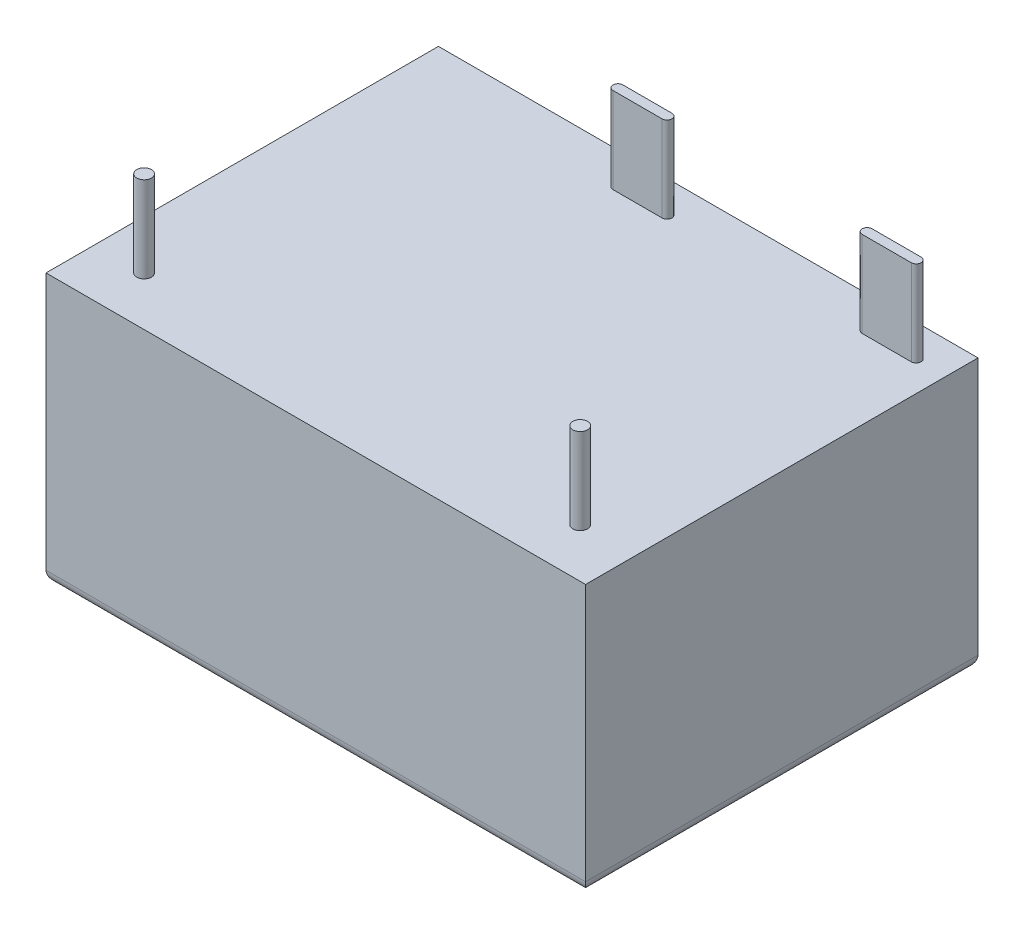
ISO-10303-21;
HEADER;
FILE_DESCRIPTION(('STEP AP214'),'2;1');
FILE_NAME('part.step','',(''),(''),'','','');
FILE_SCHEMA(('AUTOMOTIVE_DESIGN { 1 0 10303 214 1 1 1 1 }'));
ENDSEC;
DATA;
#1=APPLICATION_CONTEXT('core data for automotive mechanical design processes');
#2=APPLICATION_PROTOCOL_DEFINITION('international standard','automotive_design',2000,#1);
#3=PRODUCT_CONTEXT('',#1,'mechanical');
#4=PRODUCT('Part','Part','',(#3));
#5=PRODUCT_RELATED_PRODUCT_CATEGORY('part','',(#4));
#6=PRODUCT_DEFINITION_FORMATION('','',#4);
#7=PRODUCT_DEFINITION_CONTEXT('part definition',#1,'design');
#8=PRODUCT_DEFINITION('design','',#6,#7);
#9=PRODUCT_DEFINITION_SHAPE('','',#8);
#10=(LENGTH_UNIT() NAMED_UNIT(*) SI_UNIT(.MILLI.,.METRE.));
#11=(NAMED_UNIT(*) PLANE_ANGLE_UNIT() SI_UNIT($,.RADIAN.));
#12=(NAMED_UNIT(*) SI_UNIT($,.STERADIAN.) SOLID_ANGLE_UNIT());
#13=UNCERTAINTY_MEASURE_WITH_UNIT(LENGTH_MEASURE(1.E-05),#10,'distance_accuracy_value','');
#14=(GEOMETRIC_REPRESENTATION_CONTEXT(3) GLOBAL_UNCERTAINTY_ASSIGNED_CONTEXT((#13)) GLOBAL_UNIT_ASSIGNED_CONTEXT((#10,
#11,#12)) REPRESENTATION_CONTEXT('',''));
#15=CARTESIAN_POINT('',(0.,0.,0.));
#16=DIRECTION('',(0.,0.,1.));
#17=DIRECTION('',(1.,0.,0.));
#18=AXIS2_PLACEMENT_3D('',#15,#16,#17);
#19=CARTESIAN_POINT('',(0.,11.,0.));
#20=DIRECTION('',(0.,-1.,0.));
#21=DIRECTION('',(0.,0.,-1.));
#22=AXIS2_PLACEMENT_3D('',#19,#20,#21);
#23=PLANE('',#22);
#24=CARTESIAN_POINT('',(20.78,11.,-14.7));
#25=DIRECTION('',(0.,1.,0.));
#26=DIRECTION('',(0.,0.,1.));
#27=AXIS2_PLACEMENT_3D('',#24,#25,#26);
#28=CIRCLE('',#27,0.20000000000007);
#29=CARTESIAN_POINT('',(20.78,11.,-14.4999999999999));
#30=VERTEX_POINT('',#29);
#31=CARTESIAN_POINT('',(20.78,11.,-14.9000000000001));
#32=VERTEX_POINT('',#31);
#33=EDGE_CURVE('E163',#30,#32,#28,.T.);
#34=ORIENTED_EDGE('',*,*,#33,.F.);
#35=DIRECTION('',(1.,0.,0.));
#36=VECTOR('',#35,1.);
#37=CARTESIAN_POINT('',(20.78,11.,-14.4999999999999));
#38=LINE('',#37,#36);
#39=CARTESIAN_POINT('',(18.78,11.,-14.4999999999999));
#40=VERTEX_POINT('',#39);
#41=EDGE_CURVE('E176',#40,#30,#38,.T.);
#42=ORIENTED_EDGE('',*,*,#41,.F.);
#43=CARTESIAN_POINT('',(18.78,11.,-14.7));
#44=DIRECTION('',(0.,1.,0.));
#45=DIRECTION('',(0.,0.,1.));
#46=AXIS2_PLACEMENT_3D('',#43,#44,#45);
#47=CIRCLE('',#46,0.20000000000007);
#48=CARTESIAN_POINT('',(18.78,11.,-14.9000000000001));
#49=VERTEX_POINT('',#48);
#50=EDGE_CURVE('E185',#49,#40,#47,.T.);
#51=ORIENTED_EDGE('',*,*,#50,.F.);
#52=DIRECTION('',(-1.,0.,0.));
#53=VECTOR('',#52,1.);
#54=CARTESIAN_POINT('',(20.78,11.,-14.9000000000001));
#55=LINE('',#54,#53);
#56=EDGE_CURVE('E166',#32,#49,#55,.T.);
#57=ORIENTED_EDGE('',*,*,#56,.F.);
#58=EDGE_LOOP('',(#34,#42,#51,#57));
#59=FACE_BOUND('',#58,.T.);
#60=CARTESIAN_POINT('',(2.,11.,-2.));
#61=DIRECTION('',(0.,-1.,0.));
#62=DIRECTION('',(0.,0.,-1.));
#63=AXIS2_PLACEMENT_3D('',#60,#61,#62);
#64=CIRCLE('',#63,0.3);
#65=CARTESIAN_POINT('',(2.,11.,-2.3));
#66=VERTEX_POINT('',#65);
#67=EDGE_CURVE('E225',#66,#66,#64,.F.);
#68=ORIENTED_EDGE('',*,*,#67,.F.);
#69=EDGE_LOOP('',(#68));
#70=FACE_BOUND('',#69,.T.);
#71=DIRECTION('',(0.,0.,1.));
#72=VECTOR('',#71,1.);
#73=CARTESIAN_POINT('',(0.,11.,0.));
#74=LINE('',#73,#72);
#75=CARTESIAN_POINT('',(0.,11.,-16.));
#76=VERTEX_POINT('',#75);
#77=CARTESIAN_POINT('',(0.,11.,0.));
#78=VERTEX_POINT('',#77);
#79=EDGE_CURVE('E207',#76,#78,#74,.T.);
#80=ORIENTED_EDGE('',*,*,#79,.T.);
#81=DIRECTION('',(1.,0.,0.));
#82=VECTOR('',#81,1.);
#83=CARTESIAN_POINT('',(0.,11.,0.));
#84=LINE('',#83,#82);
#85=CARTESIAN_POINT('',(22.,11.,0.));
#86=VERTEX_POINT('',#85);
#87=EDGE_CURVE('E210',#78,#86,#84,.T.);
#88=ORIENTED_EDGE('',*,*,#87,.T.);
#89=DIRECTION('',(0.,0.,-1.));
#90=VECTOR('',#89,1.);
#91=CARTESIAN_POINT('',(22.,11.,0.));
#92=LINE('',#91,#90);
#93=CARTESIAN_POINT('',(22.,11.,-16.));
#94=VERTEX_POINT('',#93);
#95=EDGE_CURVE('E212',#86,#94,#92,.T.);
#96=ORIENTED_EDGE('',*,*,#95,.T.);
#97=DIRECTION('',(-1.,0.,0.));
#98=VECTOR('',#97,1.);
#99=CARTESIAN_POINT('',(0.,11.,-16.));
#100=LINE('',#99,#98);
#101=EDGE_CURVE('E214',#94,#76,#100,.T.);
#102=ORIENTED_EDGE('',*,*,#101,.T.);
#103=EDGE_LOOP('',(#80,#88,#96,#102));
#104=FACE_BOUND('',#103,.T.);
#105=CARTESIAN_POINT('',(19.78,11.,-2.));
#106=DIRECTION('',(0.,-1.,0.));
#107=DIRECTION('',(0.,0.,-1.));
#108=AXIS2_PLACEMENT_3D('',#105,#106,#107);
#109=CIRCLE('',#108,0.3);
#110=CARTESIAN_POINT('',(19.78,11.,-2.3));
#111=VERTEX_POINT('',#110);
#112=EDGE_CURVE('E228',#111,#111,#109,.F.);
#113=ORIENTED_EDGE('',*,*,#112,.F.);
#114=EDGE_LOOP('',(#113));
#115=FACE_BOUND('',#114,.T.);
#116=CARTESIAN_POINT('',(10.62,11.,-14.6999999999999));
#117=DIRECTION('',(0.,1.,0.));
#118=DIRECTION('',(0.,0.,1.));
#119=AXIS2_PLACEMENT_3D('',#116,#117,#118);
#120=CIRCLE('',#119,0.200000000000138);
#121=CARTESIAN_POINT('',(10.62,11.,-14.4999999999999));
#122=VERTEX_POINT('',#121);
#123=CARTESIAN_POINT('',(10.62,11.,-14.9000000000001));
#124=VERTEX_POINT('',#123);
#125=EDGE_CURVE('E162',#122,#124,#120,.T.);
#126=ORIENTED_EDGE('',*,*,#125,.F.);
#127=DIRECTION('',(1.,0.,0.));
#128=VECTOR('',#127,1.);
#129=CARTESIAN_POINT('',(10.62,11.,-14.4999999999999));
#130=LINE('',#129,#128);
#131=CARTESIAN_POINT('',(8.62,11.,-14.4999999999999));
#132=VERTEX_POINT('',#131);
#133=EDGE_CURVE('E159',#132,#122,#130,.T.);
#134=ORIENTED_EDGE('',*,*,#133,.F.);
#135=CARTESIAN_POINT('',(8.62,11.,-14.6999999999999));
#136=DIRECTION('',(0.,1.,0.));
#137=DIRECTION('',(0.,0.,1.));
#138=AXIS2_PLACEMENT_3D('',#135,#136,#137);
#139=CIRCLE('',#138,0.200000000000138);
#140=CARTESIAN_POINT('',(8.62,11.,-14.9000000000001));
#141=VERTEX_POINT('',#140);
#142=EDGE_CURVE('E260',#141,#132,#139,.T.);
#143=ORIENTED_EDGE('',*,*,#142,.F.);
#144=DIRECTION('',(-1.,0.,0.));
#145=VECTOR('',#144,1.);
#146=CARTESIAN_POINT('',(10.62,11.,-14.9000000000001));
#147=LINE('',#146,#145);
#148=EDGE_CURVE('E258',#124,#141,#147,.T.);
#149=ORIENTED_EDGE('',*,*,#148,.F.);
#150=EDGE_LOOP('',(#126,#134,#143,#149));
#151=FACE_BOUND('',#150,.T.);
#152=ADVANCED_FACE('F34',(#59,#70,#104,#115,#151),#23,.F.);
#153=CARTESIAN_POINT('',(0.,11.,0.));
#154=DIRECTION('',(1.,0.,0.));
#155=DIRECTION('',(0.,0.,-1.));
#156=AXIS2_PLACEMENT_3D('',#153,#154,#155);
#157=PLANE('',#156);
#158=DIRECTION('',(0.,-1.,0.));
#159=VECTOR('',#158,1.);
#160=CARTESIAN_POINT('',(0.,11.,-16.));
#161=LINE('',#160,#159);
#162=CARTESIAN_POINT('',(0.,0.5,-16.));
#163=VERTEX_POINT('',#162);
#164=EDGE_CURVE('E216',#76,#163,#161,.T.);
#165=ORIENTED_EDGE('',*,*,#164,.T.);
#166=DIRECTION('',(0.,0.,1.));
#167=VECTOR('',#166,1.);
#168=CARTESIAN_POINT('',(0.,0.5,0.));
#169=LINE('',#168,#167);
#170=CARTESIAN_POINT('',(0.,0.5,0.));
#171=VERTEX_POINT('',#170);
#172=EDGE_CURVE('E11',#163,#171,#169,.T.);
#173=ORIENTED_EDGE('',*,*,#172,.T.);
#174=DIRECTION('',(0.,-1.,0.));
#175=VECTOR('',#174,1.);
#176=CARTESIAN_POINT('',(0.,11.,0.));
#177=LINE('',#176,#175);
#178=EDGE_CURVE('E222',#78,#171,#177,.T.);
#179=ORIENTED_EDGE('',*,*,#178,.F.);
#180=ORIENTED_EDGE('',*,*,#79,.F.);
#181=EDGE_LOOP('',(#165,#173,#179,#180));
#182=FACE_BOUND('',#181,.T.);
#183=ADVANCED_FACE('F278',(#182),#157,.F.);
#184=CARTESIAN_POINT('',(0.,11.,0.));
#185=DIRECTION('',(0.,0.,-1.));
#186=DIRECTION('',(-1.,0.,0.));
#187=AXIS2_PLACEMENT_3D('',#184,#185,#186);
#188=PLANE('',#187);
#189=ORIENTED_EDGE('',*,*,#178,.T.);
#190=DIRECTION('',(1.,0.,0.));
#191=VECTOR('',#190,1.);
#192=CARTESIAN_POINT('',(22.,0.5,0.));
#193=LINE('',#192,#191);
#194=CARTESIAN_POINT('',(22.,0.5,0.));
#195=VERTEX_POINT('',#194);
#196=EDGE_CURVE('E231',#171,#195,#193,.T.);
#197=ORIENTED_EDGE('',*,*,#196,.T.);
#198=DIRECTION('',(0.,-1.,0.));
#199=VECTOR('',#198,1.);
#200=CARTESIAN_POINT('',(22.,11.,0.));
#201=LINE('',#200,#199);
#202=EDGE_CURVE('E220',#86,#195,#201,.T.);
#203=ORIENTED_EDGE('',*,*,#202,.F.);
#204=ORIENTED_EDGE('',*,*,#87,.F.);
#205=EDGE_LOOP('',(#189,#197,#203,#204));
#206=FACE_BOUND('',#205,.T.);
#207=ADVANCED_FACE('F284',(#206),#188,.F.);
#208=CARTESIAN_POINT('',(22.,11.,0.));
#209=DIRECTION('',(-1.,0.,0.));
#210=DIRECTION('',(0.,0.,1.));
#211=AXIS2_PLACEMENT_3D('',#208,#209,#210);
#212=PLANE('',#211);
#213=ORIENTED_EDGE('',*,*,#202,.T.);
#214=DIRECTION('',(0.,0.,-1.));
#215=VECTOR('',#214,1.);
#216=CARTESIAN_POINT('',(22.,0.5,-16.));
#217=LINE('',#216,#215);
#218=CARTESIAN_POINT('',(22.,0.5,-16.));
#219=VERTEX_POINT('',#218);
#220=EDGE_CURVE('E58',#195,#219,#217,.T.);
#221=ORIENTED_EDGE('',*,*,#220,.T.);
#222=DIRECTION('',(0.,-1.,0.));
#223=VECTOR('',#222,1.);
#224=CARTESIAN_POINT('',(22.,11.,-16.));
#225=LINE('',#224,#223);
#226=EDGE_CURVE('E218',#94,#219,#225,.T.);
#227=ORIENTED_EDGE('',*,*,#226,.F.);
#228=ORIENTED_EDGE('',*,*,#95,.F.);
#229=EDGE_LOOP('',(#213,#221,#227,#228));
#230=FACE_BOUND('',#229,.T.);
#231=ADVANCED_FACE('F299',(#230),#212,.F.);
#232=CARTESIAN_POINT('',(0.,11.,-16.));
#233=DIRECTION('',(0.,0.,1.));
#234=DIRECTION('',(1.,0.,0.));
#235=AXIS2_PLACEMENT_3D('',#232,#233,#234);
#236=PLANE('',#235);
#237=ORIENTED_EDGE('',*,*,#226,.T.);
#238=DIRECTION('',(-1.,0.,0.));
#239=VECTOR('',#238,1.);
#240=CARTESIAN_POINT('',(0.,0.5,-16.));
#241=LINE('',#240,#239);
#242=EDGE_CURVE('E43',#219,#163,#241,.T.);
#243=ORIENTED_EDGE('',*,*,#242,.T.);
#244=ORIENTED_EDGE('',*,*,#164,.F.);
#245=ORIENTED_EDGE('',*,*,#101,.F.);
#246=EDGE_LOOP('',(#237,#243,#244,#245));
#247=FACE_BOUND('',#246,.T.);
#248=ADVANCED_FACE('F295',(#247),#236,.F.);
#249=CARTESIAN_POINT('',(0.,0.,0.));
#250=DIRECTION('',(0.,-1.,0.));
#251=DIRECTION('',(0.,0.,-1.));
#252=AXIS2_PLACEMENT_3D('',#249,#250,#251);
#253=PLANE('',#252);
#254=DIRECTION('',(0.,0.,-1.));
#255=VECTOR('',#254,1.);
#256=CARTESIAN_POINT('',(21.5,0.,0.));
#257=LINE('',#256,#255);
#258=CARTESIAN_POINT('',(21.5,0.,-15.5));
#259=VERTEX_POINT('',#258);
#260=CARTESIAN_POINT('',(21.5,0.,-0.5));
#261=VERTEX_POINT('',#260);
#262=EDGE_CURVE('E238',#259,#261,#257,.F.);
#263=ORIENTED_EDGE('',*,*,#262,.T.);
#264=DIRECTION('',(1.,0.,0.));
#265=VECTOR('',#264,1.);
#266=CARTESIAN_POINT('',(0.,0.,-0.5));
#267=LINE('',#266,#265);
#268=CARTESIAN_POINT('',(0.5,0.,-0.5));
#269=VERTEX_POINT('',#268);
#270=EDGE_CURVE('E240',#261,#269,#267,.F.);
#271=ORIENTED_EDGE('',*,*,#270,.T.);
#272=DIRECTION('',(0.,0.,1.));
#273=VECTOR('',#272,1.);
#274=CARTESIAN_POINT('',(0.5,0.,-16.));
#275=LINE('',#274,#273);
#276=CARTESIAN_POINT('',(0.5,0.,-15.5));
#277=VERTEX_POINT('',#276);
#278=EDGE_CURVE('E234',#269,#277,#275,.F.);
#279=ORIENTED_EDGE('',*,*,#278,.T.);
#280=DIRECTION('',(-1.,0.,0.));
#281=VECTOR('',#280,1.);
#282=CARTESIAN_POINT('',(22.,0.,-15.5));
#283=LINE('',#282,#281);
#284=EDGE_CURVE('E236',#277,#259,#283,.F.);
#285=ORIENTED_EDGE('',*,*,#284,.T.);
#286=EDGE_LOOP('',(#263,#271,#279,#285));
#287=FACE_BOUND('',#286,.T.);
#288=ADVANCED_FACE('F292',(#287),#253,.T.);
#289=CARTESIAN_POINT('',(2.,14.5,-2.));
#290=DIRECTION('',(0.,-1.,0.));
#291=DIRECTION('',(0.,0.,-1.));
#292=AXIS2_PLACEMENT_3D('',#289,#290,#291);
#293=CYLINDRICAL_SURFACE('',#292,0.3);
#294=CARTESIAN_POINT('',(2.,14.5,-2.));
#295=DIRECTION('',(0.,1.,0.));
#296=DIRECTION('',(0.,0.,1.));
#297=AXIS2_PLACEMENT_3D('',#294,#295,#296);
#298=CIRCLE('',#297,0.3);
#299=CARTESIAN_POINT('',(2.,14.5,-1.7));
#300=VERTEX_POINT('',#299);
#301=EDGE_CURVE('E204',#300,#300,#298,.T.);
#302=ORIENTED_EDGE('',*,*,#301,.F.);
#303=EDGE_LOOP('',(#302));
#304=FACE_BOUND('',#303,.T.);
#305=ORIENTED_EDGE('',*,*,#67,.T.);
#306=EDGE_LOOP('',(#305));
#307=FACE_BOUND('',#306,.T.);
#308=ADVANCED_FACE('F290',(#304,#307),#293,.T.);
#309=CARTESIAN_POINT('',(2.,14.5,-2.));
#310=DIRECTION('',(0.,1.,0.));
#311=DIRECTION('',(0.,0.,1.));
#312=AXIS2_PLACEMENT_3D('',#309,#310,#311);
#313=PLANE('',#312);
#314=ORIENTED_EDGE('',*,*,#301,.T.);
#315=EDGE_LOOP('',(#314));
#316=FACE_BOUND('',#315,.T.);
#317=ADVANCED_FACE('F338',(#316),#313,.T.);
#318=CARTESIAN_POINT('',(19.78,14.5,-2.));
#319=DIRECTION('',(0.,-1.,0.));
#320=DIRECTION('',(0.,0.,-1.));
#321=AXIS2_PLACEMENT_3D('',#318,#319,#320);
#322=CYLINDRICAL_SURFACE('',#321,0.3);
#323=CARTESIAN_POINT('',(19.78,14.5,-2.));
#324=DIRECTION('',(0.,1.,0.));
#325=DIRECTION('',(0.,0.,1.));
#326=AXIS2_PLACEMENT_3D('',#323,#324,#325);
#327=CIRCLE('',#326,0.3);
#328=CARTESIAN_POINT('',(19.78,14.5,-1.7));
#329=VERTEX_POINT('',#328);
#330=EDGE_CURVE('E201',#329,#329,#327,.T.);
#331=ORIENTED_EDGE('',*,*,#330,.F.);
#332=EDGE_LOOP('',(#331));
#333=FACE_BOUND('',#332,.T.);
#334=ORIENTED_EDGE('',*,*,#112,.T.);
#335=EDGE_LOOP('',(#334));
#336=FACE_BOUND('',#335,.T.);
#337=ADVANCED_FACE('F335',(#333,#336),#322,.T.);
#338=CARTESIAN_POINT('',(19.78,14.5,-2.));
#339=DIRECTION('',(0.,1.,0.));
#340=DIRECTION('',(0.,0.,1.));
#341=AXIS2_PLACEMENT_3D('',#338,#339,#340);
#342=PLANE('',#341);
#343=ORIENTED_EDGE('',*,*,#330,.T.);
#344=EDGE_LOOP('',(#343));
#345=FACE_BOUND('',#344,.T.);
#346=ADVANCED_FACE('F337',(#345),#342,.T.);
#347=CARTESIAN_POINT('',(20.78,14.5,-14.7));
#348=DIRECTION('',(0.,-1.,0.));
#349=DIRECTION('',(0.,0.,-1.));
#350=AXIS2_PLACEMENT_3D('',#347,#348,#349);
#351=CYLINDRICAL_SURFACE('',#350,0.20000000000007);
#352=ORIENTED_EDGE('',*,*,#33,.T.);
#353=DIRECTION('',(0.,-1.,0.));
#354=VECTOR('',#353,1.);
#355=CARTESIAN_POINT('',(20.78,14.5,-14.9000000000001));
#356=LINE('',#355,#354);
#357=CARTESIAN_POINT('',(20.78,14.5,-14.9000000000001));
#358=VERTEX_POINT('',#357);
#359=EDGE_CURVE('E198',#358,#32,#356,.T.);
#360=ORIENTED_EDGE('',*,*,#359,.F.);
#361=CARTESIAN_POINT('',(20.78,14.5,-14.7));
#362=DIRECTION('',(0.,1.,0.));
#363=DIRECTION('',(0.,0.,1.));
#364=AXIS2_PLACEMENT_3D('',#361,#362,#363);
#365=CIRCLE('',#364,0.20000000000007);
#366=CARTESIAN_POINT('',(20.78,14.5,-14.4999999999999));
#367=VERTEX_POINT('',#366);
#368=EDGE_CURVE('E172',#367,#358,#365,.T.);
#369=ORIENTED_EDGE('',*,*,#368,.F.);
#370=DIRECTION('',(0.,-1.,0.));
#371=VECTOR('',#370,1.);
#372=CARTESIAN_POINT('',(20.78,14.5,-14.4999999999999));
#373=LINE('',#372,#371);
#374=EDGE_CURVE('E181',#367,#30,#373,.T.);
#375=ORIENTED_EDGE('',*,*,#374,.T.);
#376=EDGE_LOOP('',(#352,#360,#369,#375));
#377=FACE_BOUND('',#376,.T.);
#378=ADVANCED_FACE('F345',(#377),#351,.T.);
#379=CARTESIAN_POINT('',(20.78,14.5,-14.9000000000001));
#380=DIRECTION('',(0.,0.,1.));
#381=DIRECTION('',(1.,0.,0.));
#382=AXIS2_PLACEMENT_3D('',#379,#380,#381);
#383=PLANE('',#382);
#384=ORIENTED_EDGE('',*,*,#56,.T.);
#385=DIRECTION('',(0.,-1.,0.));
#386=VECTOR('',#385,1.);
#387=CARTESIAN_POINT('',(18.78,14.5,-14.9000000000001));
#388=LINE('',#387,#386);
#389=CARTESIAN_POINT('',(18.78,14.5,-14.9000000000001));
#390=VERTEX_POINT('',#389);
#391=EDGE_CURVE('E195',#390,#49,#388,.T.);
#392=ORIENTED_EDGE('',*,*,#391,.F.);
#393=DIRECTION('',(-1.,0.,0.));
#394=VECTOR('',#393,1.);
#395=CARTESIAN_POINT('',(20.78,14.5,-14.9000000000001));
#396=LINE('',#395,#394);
#397=EDGE_CURVE('E175',#358,#390,#396,.T.);
#398=ORIENTED_EDGE('',*,*,#397,.F.);
#399=ORIENTED_EDGE('',*,*,#359,.T.);
#400=EDGE_LOOP('',(#384,#392,#398,#399));
#401=FACE_BOUND('',#400,.T.);
#402=ADVANCED_FACE('F353',(#401),#383,.F.);
#403=CARTESIAN_POINT('',(18.78,14.5,-14.7));
#404=DIRECTION('',(0.,-1.,0.));
#405=DIRECTION('',(0.,0.,-1.));
#406=AXIS2_PLACEMENT_3D('',#403,#404,#405);
#407=CYLINDRICAL_SURFACE('',#406,0.20000000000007);
#408=ORIENTED_EDGE('',*,*,#50,.T.);
#409=DIRECTION('',(0.,-1.,0.));
#410=VECTOR('',#409,1.);
#411=CARTESIAN_POINT('',(18.78,14.5,-14.4999999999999));
#412=LINE('',#411,#410);
#413=CARTESIAN_POINT('',(18.78,14.5,-14.4999999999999));
#414=VERTEX_POINT('',#413);
#415=EDGE_CURVE('E192',#414,#40,#412,.T.);
#416=ORIENTED_EDGE('',*,*,#415,.F.);
#417=CARTESIAN_POINT('',(18.78,14.5,-14.7));
#418=DIRECTION('',(0.,1.,0.));
#419=DIRECTION('',(0.,0.,1.));
#420=AXIS2_PLACEMENT_3D('',#417,#418,#419);
#421=CIRCLE('',#420,0.20000000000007);
#422=EDGE_CURVE('E178',#390,#414,#421,.T.);
#423=ORIENTED_EDGE('',*,*,#422,.F.);
#424=ORIENTED_EDGE('',*,*,#391,.T.);
#425=EDGE_LOOP('',(#408,#416,#423,#424));
#426=FACE_BOUND('',#425,.T.);
#427=ADVANCED_FACE('F357',(#426),#407,.T.);
#428=CARTESIAN_POINT('',(20.78,14.5,-14.4999999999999));
#429=DIRECTION('',(0.,0.,-1.));
#430=DIRECTION('',(-1.,0.,0.));
#431=AXIS2_PLACEMENT_3D('',#428,#429,#430);
#432=PLANE('',#431);
#433=ORIENTED_EDGE('',*,*,#41,.T.);
#434=ORIENTED_EDGE('',*,*,#374,.F.);
#435=DIRECTION('',(1.,0.,0.));
#436=VECTOR('',#435,1.);
#437=CARTESIAN_POINT('',(20.78,14.5,-14.4999999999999));
#438=LINE('',#437,#436);
#439=EDGE_CURVE('E180',#414,#367,#438,.T.);
#440=ORIENTED_EDGE('',*,*,#439,.F.);
#441=ORIENTED_EDGE('',*,*,#415,.T.);
#442=EDGE_LOOP('',(#433,#434,#440,#441));
#443=FACE_BOUND('',#442,.T.);
#444=ADVANCED_FACE('F361',(#443),#432,.F.);
#445=CARTESIAN_POINT('',(20.78,14.5,-14.7));
#446=DIRECTION('',(0.,1.,0.));
#447=DIRECTION('',(0.,0.,1.));
#448=AXIS2_PLACEMENT_3D('',#445,#446,#447);
#449=PLANE('',#448);
#450=ORIENTED_EDGE('',*,*,#368,.T.);
#451=ORIENTED_EDGE('',*,*,#397,.T.);
#452=ORIENTED_EDGE('',*,*,#422,.T.);
#453=ORIENTED_EDGE('',*,*,#439,.T.);
#454=EDGE_LOOP('',(#450,#451,#452,#453));
#455=FACE_BOUND('',#454,.T.);
#456=ADVANCED_FACE('F365',(#455),#449,.T.);
#457=CARTESIAN_POINT('',(10.62,14.5,-14.6999999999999));
#458=DIRECTION('',(0.,-1.,0.));
#459=DIRECTION('',(0.,0.,-1.));
#460=AXIS2_PLACEMENT_3D('',#457,#458,#459);
#461=CYLINDRICAL_SURFACE('',#460,0.200000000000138);
#462=ORIENTED_EDGE('',*,*,#125,.T.);
#463=DIRECTION('',(0.,-1.,0.));
#464=VECTOR('',#463,1.);
#465=CARTESIAN_POINT('',(10.62,14.5,-14.9000000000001));
#466=LINE('',#465,#464);
#467=CARTESIAN_POINT('',(10.62,14.5,-14.9000000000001));
#468=VERTEX_POINT('',#467);
#469=EDGE_CURVE('E143',#468,#124,#466,.T.);
#470=ORIENTED_EDGE('',*,*,#469,.F.);
#471=CARTESIAN_POINT('',(10.62,14.5,-14.6999999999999));
#472=DIRECTION('',(0.,1.,0.));
#473=DIRECTION('',(0.,0.,1.));
#474=AXIS2_PLACEMENT_3D('',#471,#472,#473);
#475=CIRCLE('',#474,0.200000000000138);
#476=CARTESIAN_POINT('',(10.62,14.5,-14.4999999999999));
#477=VERTEX_POINT('',#476);
#478=EDGE_CURVE('E150',#477,#468,#475,.T.);
#479=ORIENTED_EDGE('',*,*,#478,.F.);
#480=DIRECTION('',(0.,-1.,0.));
#481=VECTOR('',#480,1.);
#482=CARTESIAN_POINT('',(10.62,14.5,-14.4999999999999));
#483=LINE('',#482,#481);
#484=EDGE_CURVE('E269',#477,#122,#483,.T.);
#485=ORIENTED_EDGE('',*,*,#484,.T.);
#486=EDGE_LOOP('',(#462,#470,#479,#485));
#487=FACE_BOUND('',#486,.T.);
#488=ADVANCED_FACE('F161',(#487),#461,.T.);
#489=CARTESIAN_POINT('',(10.62,14.5,-14.9000000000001));
#490=DIRECTION('',(0.,0.,1.));
#491=DIRECTION('',(1.,0.,0.));
#492=AXIS2_PLACEMENT_3D('',#489,#490,#491);
#493=PLANE('',#492);
#494=ORIENTED_EDGE('',*,*,#148,.T.);
#495=DIRECTION('',(0.,-1.,0.));
#496=VECTOR('',#495,1.);
#497=CARTESIAN_POINT('',(8.62,14.5,-14.9000000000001));
#498=LINE('',#497,#496);
#499=CARTESIAN_POINT('',(8.62,14.5,-14.9000000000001));
#500=VERTEX_POINT('',#499);
#501=EDGE_CURVE('E146',#500,#141,#498,.T.);
#502=ORIENTED_EDGE('',*,*,#501,.F.);
#503=DIRECTION('',(-1.,0.,0.));
#504=VECTOR('',#503,1.);
#505=CARTESIAN_POINT('',(10.62,14.5,-14.9000000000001));
#506=LINE('',#505,#504);
#507=EDGE_CURVE('E138',#468,#500,#506,.T.);
#508=ORIENTED_EDGE('',*,*,#507,.F.);
#509=ORIENTED_EDGE('',*,*,#469,.T.);
#510=EDGE_LOOP('',(#494,#502,#508,#509));
#511=FACE_BOUND('',#510,.T.);
#512=ADVANCED_FACE('F141',(#511),#493,.F.);
#513=CARTESIAN_POINT('',(8.62,14.5,-14.6999999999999));
#514=DIRECTION('',(0.,-1.,0.));
#515=DIRECTION('',(0.,0.,-1.));
#516=AXIS2_PLACEMENT_3D('',#513,#514,#515);
#517=CYLINDRICAL_SURFACE('',#516,0.200000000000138);
#518=ORIENTED_EDGE('',*,*,#142,.T.);
#519=DIRECTION('',(0.,-1.,0.));
#520=VECTOR('',#519,1.);
#521=CARTESIAN_POINT('',(8.62,14.5,-14.4999999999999));
#522=LINE('',#521,#520);
#523=CARTESIAN_POINT('',(8.62,14.5,-14.4999999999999));
#524=VERTEX_POINT('',#523);
#525=EDGE_CURVE('E168',#524,#132,#522,.T.);
#526=ORIENTED_EDGE('',*,*,#525,.F.);
#527=CARTESIAN_POINT('',(8.62,14.5,-14.6999999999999));
#528=DIRECTION('',(0.,1.,0.));
#529=DIRECTION('',(0.,0.,1.));
#530=AXIS2_PLACEMENT_3D('',#527,#528,#529);
#531=CIRCLE('',#530,0.200000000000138);
#532=EDGE_CURVE('E149',#500,#524,#531,.T.);
#533=ORIENTED_EDGE('',*,*,#532,.F.);
#534=ORIENTED_EDGE('',*,*,#501,.T.);
#535=EDGE_LOOP('',(#518,#526,#533,#534));
#536=FACE_BOUND('',#535,.T.);
#537=ADVANCED_FACE('F275',(#536),#517,.T.);
#538=CARTESIAN_POINT('',(10.62,14.5,-14.4999999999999));
#539=DIRECTION('',(0.,0.,-1.));
#540=DIRECTION('',(-1.,0.,0.));
#541=AXIS2_PLACEMENT_3D('',#538,#539,#540);
#542=PLANE('',#541);
#543=ORIENTED_EDGE('',*,*,#133,.T.);
#544=ORIENTED_EDGE('',*,*,#484,.F.);
#545=DIRECTION('',(1.,0.,0.));
#546=VECTOR('',#545,1.);
#547=CARTESIAN_POINT('',(10.62,14.5,-14.4999999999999));
#548=LINE('',#547,#546);
#549=EDGE_CURVE('E155',#524,#477,#548,.T.);
#550=ORIENTED_EDGE('',*,*,#549,.F.);
#551=ORIENTED_EDGE('',*,*,#525,.T.);
#552=EDGE_LOOP('',(#543,#544,#550,#551));
#553=FACE_BOUND('',#552,.T.);
#554=ADVANCED_FACE('F273',(#553),#542,.F.);
#555=CARTESIAN_POINT('',(10.62,14.5,-14.6999999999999));
#556=DIRECTION('',(0.,1.,0.));
#557=DIRECTION('',(0.,0.,1.));
#558=AXIS2_PLACEMENT_3D('',#555,#556,#557);
#559=PLANE('',#558);
#560=ORIENTED_EDGE('',*,*,#478,.T.);
#561=ORIENTED_EDGE('',*,*,#507,.T.);
#562=ORIENTED_EDGE('',*,*,#532,.T.);
#563=ORIENTED_EDGE('',*,*,#549,.T.);
#564=EDGE_LOOP('',(#560,#561,#562,#563));
#565=FACE_BOUND('',#564,.T.);
#566=ADVANCED_FACE('F153',(#565),#559,.T.);
#567=CARTESIAN_POINT('',(0.,0.5,-15.5));
#568=DIRECTION('',(1.,0.,0.));
#569=DIRECTION('',(0.,0.,-1.));
#570=AXIS2_PLACEMENT_3D('',#567,#568,#569);
#571=CYLINDRICAL_SURFACE('',#570,0.5);
#572=CARTESIAN_POINT('',(21.5,0.5,-15.5));
#573=DIRECTION('',(0.707106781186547,0.,0.707106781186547));
#574=DIRECTION('',(0.707106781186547,0.,-0.707106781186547));
#575=AXIS2_PLACEMENT_3D('',#572,#573,#574);
#576=ELLIPSE('',#575,0.707106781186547,0.5);
#577=EDGE_CURVE('E248',#259,#219,#576,.T.);
#578=ORIENTED_EDGE('',*,*,#577,.F.);
#579=ORIENTED_EDGE('',*,*,#284,.F.);
#580=CARTESIAN_POINT('',(0.5,0.5,-15.5));
#581=DIRECTION('',(0.707106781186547,0.,-0.707106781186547));
#582=DIRECTION('',(-0.707106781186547,0.,-0.707106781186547));
#583=AXIS2_PLACEMENT_3D('',#580,#581,#582);
#584=ELLIPSE('',#583,0.707106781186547,0.5);
#585=EDGE_CURVE('E38',#163,#277,#584,.F.);
#586=ORIENTED_EDGE('',*,*,#585,.F.);
#587=ORIENTED_EDGE('',*,*,#242,.F.);
#588=EDGE_LOOP('',(#578,#579,#586,#587));
#589=FACE_BOUND('',#588,.T.);
#590=ADVANCED_FACE('F36',(#589),#571,.T.);
#591=CARTESIAN_POINT('',(0.5,0.5,0.));
#592=DIRECTION('',(0.,0.,-1.));
#593=DIRECTION('',(-1.,0.,0.));
#594=AXIS2_PLACEMENT_3D('',#591,#592,#593);
#595=CYLINDRICAL_SURFACE('',#594,0.5);
#596=ORIENTED_EDGE('',*,*,#585,.T.);
#597=ORIENTED_EDGE('',*,*,#278,.F.);
#598=CARTESIAN_POINT('',(0.5,0.5,-0.5));
#599=DIRECTION('',(-0.707106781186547,0.,-0.707106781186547));
#600=DIRECTION('',(0.707106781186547,0.,-0.707106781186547));
#601=AXIS2_PLACEMENT_3D('',#598,#599,#600);
#602=ELLIPSE('',#601,0.707106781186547,0.5);
#603=EDGE_CURVE('E247',#171,#269,#602,.F.);
#604=ORIENTED_EDGE('',*,*,#603,.F.);
#605=ORIENTED_EDGE('',*,*,#172,.F.);
#606=EDGE_LOOP('',(#596,#597,#604,#605));
#607=FACE_BOUND('',#606,.T.);
#608=ADVANCED_FACE('F311',(#607),#595,.T.);
#609=CARTESIAN_POINT('',(21.5,0.5,0.));
#610=DIRECTION('',(0.,0.,1.));
#611=DIRECTION('',(1.,0.,0.));
#612=AXIS2_PLACEMENT_3D('',#609,#610,#611);
#613=CYLINDRICAL_SURFACE('',#612,0.5);
#614=ORIENTED_EDGE('',*,*,#577,.T.);
#615=ORIENTED_EDGE('',*,*,#220,.F.);
#616=CARTESIAN_POINT('',(21.5,0.5,-0.5));
#617=DIRECTION('',(-0.707106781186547,0.,0.707106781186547));
#618=DIRECTION('',(0.707106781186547,0.,0.707106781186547));
#619=AXIS2_PLACEMENT_3D('',#616,#617,#618);
#620=ELLIPSE('',#619,0.707106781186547,0.5);
#621=EDGE_CURVE('E245',#261,#195,#620,.T.);
#622=ORIENTED_EDGE('',*,*,#621,.F.);
#623=ORIENTED_EDGE('',*,*,#262,.F.);
#624=EDGE_LOOP('',(#614,#615,#622,#623));
#625=FACE_BOUND('',#624,.T.);
#626=ADVANCED_FACE('F308',(#625),#613,.T.);
#627=CARTESIAN_POINT('',(0.,0.5,-0.5));
#628=DIRECTION('',(-1.,0.,0.));
#629=DIRECTION('',(0.,0.,1.));
#630=AXIS2_PLACEMENT_3D('',#627,#628,#629);
#631=CYLINDRICAL_SURFACE('',#630,0.5);
#632=ORIENTED_EDGE('',*,*,#603,.T.);
#633=ORIENTED_EDGE('',*,*,#270,.F.);
#634=ORIENTED_EDGE('',*,*,#621,.T.);
#635=ORIENTED_EDGE('',*,*,#196,.F.);
#636=EDGE_LOOP('',(#632,#633,#634,#635));
#637=FACE_BOUND('',#636,.T.);
#638=ADVANCED_FACE('F305',(#637),#631,.T.);
#639=CLOSED_SHELL('',(#152,#183,#207,#231,#248,#288,#308,#317,#337,#346,#378,#402,#427,#444,
#456,#488,#512,#537,#554,#566,#590,#608,#626,#638));
#640=MANIFOLD_SOLID_BREP('B2',#639);
#641=ADVANCED_BREP_SHAPE_REPRESENTATION('',(#18,#640),#14);
#642=SHAPE_DEFINITION_REPRESENTATION(#9,#641);
ENDSEC;
END-ISO-10303-21;
